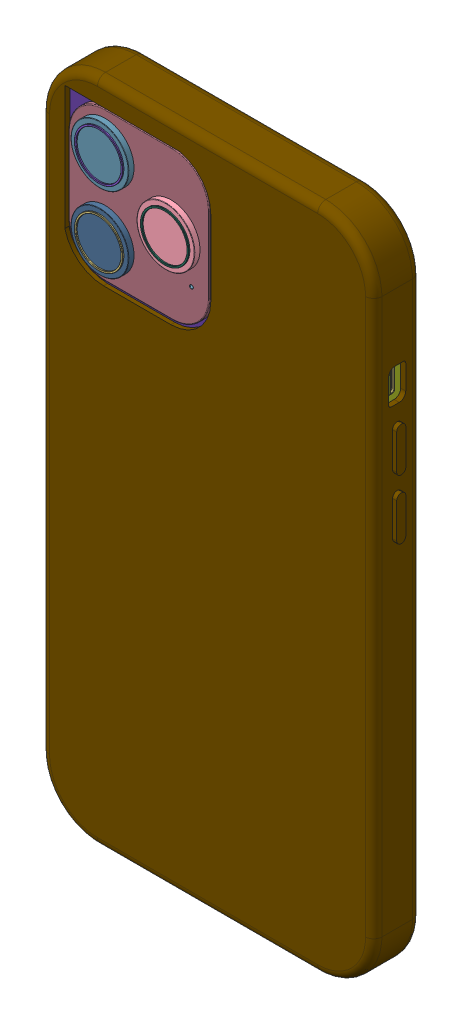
SolidWorks assembly DAY 10 IPHONE 12 PRO MAX PHONECASE.sldasm, configuration Défaut (file format 9000). Lengths in mm.
Overall size (83.5 163.5 12.75).
18 component instances, 18 part files, 0 mates.
Components (placement in the parent):
- Component1-1: Component1.sldprt [Défaut] at origin size (76.32 158.32 8.01)
- Component2-1: Component2.sldprt [Défaut] at origin size (0.36 17.63 2.64)
- Component3-1: Component3.sldprt [Défaut] at origin size (11.85 11.85 0.3)
- Component4-1: Component4.sldprt [Défaut] at origin size (14.14 14.14 1.35)
- Component5-1: Component5.sldprt [Défaut] at origin size (0.93 0.93 1.01)
- Component6-1: Component6.sldprt [Défaut] at origin size (0.65 16.25 3.14)
- Component7-1: Component7.sldprt [Défaut] at origin size (78.6 160 8)
- Component8-1: Component8.sldprt [Défaut] at origin size (11.85 11.85 0.3)
- Component9-1: Component9.sldprt [Défaut] at origin size (0.26 21.55 3.85)
- Component10-1: Component10.sldprt [Défaut] at origin size (14.14 14.14 1.35)
- Component11-1: Component11.sldprt [Défaut] at origin size (0.5 11 2.45)
- Component12-1: Component12.sldprt [Défaut] at origin size (0.75 6.2 2.2)
- Component13-1: Component13.sldprt [Défaut] at origin size (34.5 36.5 1.35)
- Component14-1: Component14.sldprt [Défaut] at origin size (14.14 14.14 1.35)
- Component15-1: Component15.sldprt [Défaut] at origin size (11.85 11.85 0.3)
- Component16-1: Component16.sldprt [Défaut] at origin size (0.5 11 2.45)
- Component17-1: Component17.sldprt [Défaut] at origin size (76.3 158.3 8.01)
- phone case bumper-1: phone case bumper.sldprt [Défaut] at origin size (83.5 163.5 11.5)
